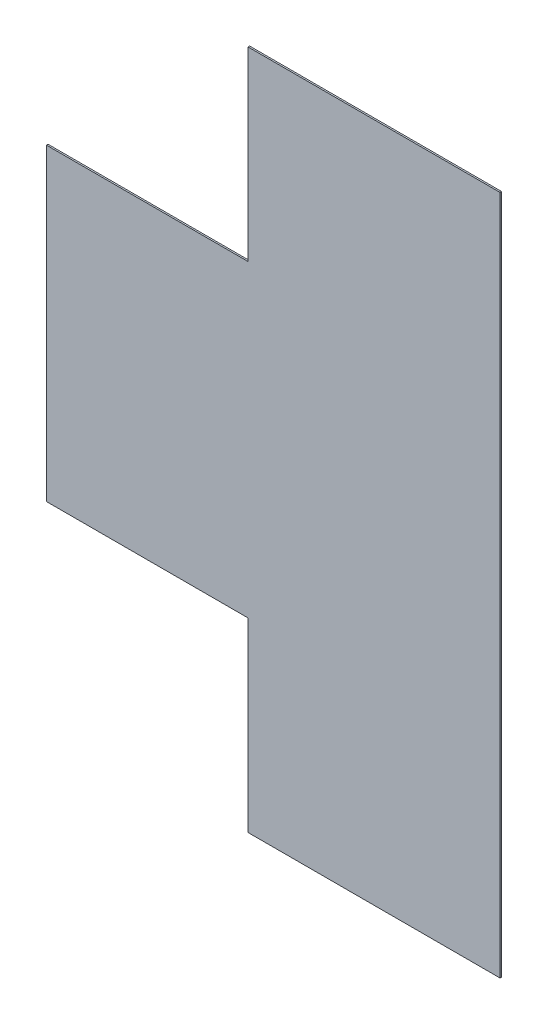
ISO-10303-21;
HEADER;
FILE_DESCRIPTION(('STEP AP214'),'2;1');
FILE_NAME('part.step','',(''),(''),'','','');
FILE_SCHEMA(('AUTOMOTIVE_DESIGN { 1 0 10303 214 1 1 1 1 }'));
ENDSEC;
DATA;
#1=APPLICATION_CONTEXT('core data for automotive mechanical design processes');
#2=APPLICATION_PROTOCOL_DEFINITION('international standard','automotive_design',2000,#1);
#3=PRODUCT_CONTEXT('',#1,'mechanical');
#4=PRODUCT('Part','Part','',(#3));
#5=PRODUCT_RELATED_PRODUCT_CATEGORY('part','',(#4));
#6=PRODUCT_DEFINITION_FORMATION('','',#4);
#7=PRODUCT_DEFINITION_CONTEXT('part definition',#1,'design');
#8=PRODUCT_DEFINITION('design','',#6,#7);
#9=PRODUCT_DEFINITION_SHAPE('','',#8);
#10=(LENGTH_UNIT() NAMED_UNIT(*) SI_UNIT(.MILLI.,.METRE.));
#11=(NAMED_UNIT(*) PLANE_ANGLE_UNIT() SI_UNIT($,.RADIAN.));
#12=(NAMED_UNIT(*) SI_UNIT($,.STERADIAN.) SOLID_ANGLE_UNIT());
#13=UNCERTAINTY_MEASURE_WITH_UNIT(LENGTH_MEASURE(1.E-05),#10,'distance_accuracy_value','');
#14=(GEOMETRIC_REPRESENTATION_CONTEXT(3) GLOBAL_UNCERTAINTY_ASSIGNED_CONTEXT((#13)) GLOBAL_UNIT_ASSIGNED_CONTEXT((#10,
#11,#12)) REPRESENTATION_CONTEXT('',''));
#15=CARTESIAN_POINT('',(0.,0.,0.));
#16=DIRECTION('',(0.,0.,1.));
#17=DIRECTION('',(1.,0.,0.));
#18=AXIS2_PLACEMENT_3D('',#15,#16,#17);
#19=CARTESIAN_POINT('',(279.786998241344,-307.771038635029,1.5875));
#20=DIRECTION('',(-1.,0.,0.));
#21=DIRECTION('',(0.,0.,1.));
#22=AXIS2_PLACEMENT_3D('',#19,#20,#21);
#23=PLANE('',#22);
#24=DIRECTION('',(0.,1.,0.));
#25=VECTOR('',#24,1.);
#26=CARTESIAN_POINT('',(279.786998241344,-307.771038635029,0.));
#27=LINE('',#26,#25);
#28=CARTESIAN_POINT('',(279.786998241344,-993.571038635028,0.));
#29=VERTEX_POINT('',#28);
#30=CARTESIAN_POINT('',(279.786998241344,-307.771038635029,0.));
#31=VERTEX_POINT('',#30);
#32=EDGE_CURVE('E132',#29,#31,#27,.T.);
#33=ORIENTED_EDGE('',*,*,#32,.T.);
#34=DIRECTION('',(0.,0.,-1.));
#35=VECTOR('',#34,1.);
#36=CARTESIAN_POINT('',(279.786998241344,-307.771038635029,1.5875));
#37=LINE('',#36,#35);
#38=CARTESIAN_POINT('',(279.786998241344,-307.771038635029,1.5875));
#39=VERTEX_POINT('',#38);
#40=EDGE_CURVE('E11',#39,#31,#37,.T.);
#41=ORIENTED_EDGE('',*,*,#40,.F.);
#42=DIRECTION('',(0.,1.,0.));
#43=VECTOR('',#42,1.);
#44=CARTESIAN_POINT('',(279.786998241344,-307.771038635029,1.5875));
#45=LINE('',#44,#43);
#46=CARTESIAN_POINT('',(279.786998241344,-993.571038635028,1.5875));
#47=VERTEX_POINT('',#46);
#48=EDGE_CURVE('E146',#47,#39,#45,.T.);
#49=ORIENTED_EDGE('',*,*,#48,.F.);
#50=DIRECTION('',(0.,0.,-1.));
#51=VECTOR('',#50,1.);
#52=CARTESIAN_POINT('',(279.786998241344,-993.571038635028,1.5875));
#53=LINE('',#52,#51);
#54=EDGE_CURVE('E128',#47,#29,#53,.T.);
#55=ORIENTED_EDGE('',*,*,#54,.T.);
#56=EDGE_LOOP('',(#33,#41,#49,#55));
#57=FACE_BOUND('',#56,.T.);
#58=ADVANCED_FACE('F36',(#57),#23,.F.);
#59=CARTESIAN_POINT('',(279.786998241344,-307.771038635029,1.5875));
#60=DIRECTION('',(0.,-1.,0.));
#61=DIRECTION('',(0.,0.,-1.));
#62=AXIS2_PLACEMENT_3D('',#59,#60,#61);
#63=PLANE('',#62);
#64=DIRECTION('',(-1.,0.,0.));
#65=VECTOR('',#64,1.);
#66=CARTESIAN_POINT('',(279.786998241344,-307.771038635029,0.));
#67=LINE('',#66,#65);
#68=CARTESIAN_POINT('',(25.7869982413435,-307.771038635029,0.));
#69=VERTEX_POINT('',#68);
#70=EDGE_CURVE('E135',#31,#69,#67,.T.);
#71=ORIENTED_EDGE('',*,*,#70,.T.);
#72=DIRECTION('',(0.,0.,-1.));
#73=VECTOR('',#72,1.);
#74=CARTESIAN_POINT('',(25.7869982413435,-307.771038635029,1.5875));
#75=LINE('',#74,#73);
#76=CARTESIAN_POINT('',(25.7869982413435,-307.771038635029,1.5875));
#77=VERTEX_POINT('',#76);
#78=EDGE_CURVE('E44',#77,#69,#75,.T.);
#79=ORIENTED_EDGE('',*,*,#78,.F.);
#80=DIRECTION('',(-1.,0.,0.));
#81=VECTOR('',#80,1.);
#82=CARTESIAN_POINT('',(279.786998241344,-307.771038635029,1.5875));
#83=LINE('',#82,#81);
#84=EDGE_CURVE('E95',#39,#77,#83,.T.);
#85=ORIENTED_EDGE('',*,*,#84,.F.);
#86=ORIENTED_EDGE('',*,*,#40,.T.);
#87=EDGE_LOOP('',(#71,#79,#85,#86));
#88=FACE_BOUND('',#87,.T.);
#89=ADVANCED_FACE('F181',(#88),#63,.F.);
#90=CARTESIAN_POINT('',(25.7869982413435,-307.771038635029,1.5875));
#91=DIRECTION('',(1.,0.,0.));
#92=DIRECTION('',(0.,1.,0.));
#93=AXIS2_PLACEMENT_3D('',#90,#91,#92);
#94=PLANE('',#93);
#95=DIRECTION('',(0.,-1.,0.));
#96=VECTOR('',#95,1.);
#97=CARTESIAN_POINT('',(25.7869982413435,-307.771038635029,0.));
#98=LINE('',#97,#96);
#99=CARTESIAN_POINT('',(25.7869982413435,-495.096038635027,0.));
#100=VERTEX_POINT('',#99);
#101=EDGE_CURVE('E137',#69,#100,#98,.T.);
#102=ORIENTED_EDGE('',*,*,#101,.T.);
#103=DIRECTION('',(0.,0.,-1.));
#104=VECTOR('',#103,1.);
#105=CARTESIAN_POINT('',(25.7869982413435,-495.096038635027,1.5875));
#106=LINE('',#105,#104);
#107=CARTESIAN_POINT('',(25.7869982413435,-495.096038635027,1.5875));
#108=VERTEX_POINT('',#107);
#109=EDGE_CURVE('E153',#108,#100,#106,.T.);
#110=ORIENTED_EDGE('',*,*,#109,.F.);
#111=DIRECTION('',(0.,-1.,0.));
#112=VECTOR('',#111,1.);
#113=CARTESIAN_POINT('',(25.7869982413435,-307.771038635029,1.5875));
#114=LINE('',#113,#112);
#115=EDGE_CURVE('E161',#77,#108,#114,.T.);
#116=ORIENTED_EDGE('',*,*,#115,.F.);
#117=ORIENTED_EDGE('',*,*,#78,.T.);
#118=EDGE_LOOP('',(#102,#110,#116,#117));
#119=FACE_BOUND('',#118,.T.);
#120=ADVANCED_FACE('F159',(#119),#94,.F.);
#121=CARTESIAN_POINT('',(-177.413001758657,-495.096038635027,1.5875));
#122=DIRECTION('',(0.,-1.,0.));
#123=DIRECTION('',(0.,0.,-1.));
#124=AXIS2_PLACEMENT_3D('',#121,#122,#123);
#125=PLANE('',#124);
#126=DIRECTION('',(-1.,0.,0.));
#127=VECTOR('',#126,1.);
#128=CARTESIAN_POINT('',(-177.413001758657,-495.096038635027,0.));
#129=LINE('',#128,#127);
#130=CARTESIAN_POINT('',(-177.413001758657,-495.096038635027,0.));
#131=VERTEX_POINT('',#130);
#132=EDGE_CURVE('E139',#100,#131,#129,.T.);
#133=ORIENTED_EDGE('',*,*,#132,.T.);
#134=DIRECTION('',(0.,0.,-1.));
#135=VECTOR('',#134,1.);
#136=CARTESIAN_POINT('',(-177.413001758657,-495.096038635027,1.5875));
#137=LINE('',#136,#135);
#138=CARTESIAN_POINT('',(-177.413001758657,-495.096038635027,1.5875));
#139=VERTEX_POINT('',#138);
#140=EDGE_CURVE('E150',#139,#131,#137,.T.);
#141=ORIENTED_EDGE('',*,*,#140,.F.);
#142=DIRECTION('',(-1.,0.,0.));
#143=VECTOR('',#142,1.);
#144=CARTESIAN_POINT('',(-177.413001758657,-495.096038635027,1.5875));
#145=LINE('',#144,#143);
#146=EDGE_CURVE('E173',#108,#139,#145,.T.);
#147=ORIENTED_EDGE('',*,*,#146,.F.);
#148=ORIENTED_EDGE('',*,*,#109,.T.);
#149=EDGE_LOOP('',(#133,#141,#147,#148));
#150=FACE_BOUND('',#149,.T.);
#151=ADVANCED_FACE('F169',(#150),#125,.F.);
#152=CARTESIAN_POINT('',(-177.413001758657,-806.246038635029,1.5875));
#153=DIRECTION('',(1.,0.,0.));
#154=DIRECTION('',(0.,0.,-1.));
#155=AXIS2_PLACEMENT_3D('',#152,#153,#154);
#156=PLANE('',#155);
#157=DIRECTION('',(0.,-1.,0.));
#158=VECTOR('',#157,1.);
#159=CARTESIAN_POINT('',(-177.413001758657,-806.246038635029,0.));
#160=LINE('',#159,#158);
#161=CARTESIAN_POINT('',(-177.413001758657,-806.246038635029,0.));
#162=VERTEX_POINT('',#161);
#163=EDGE_CURVE('E141',#131,#162,#160,.T.);
#164=ORIENTED_EDGE('',*,*,#163,.T.);
#165=DIRECTION('',(0.,0.,-1.));
#166=VECTOR('',#165,1.);
#167=CARTESIAN_POINT('',(-177.413001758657,-806.246038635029,1.5875));
#168=LINE('',#167,#166);
#169=CARTESIAN_POINT('',(-177.413001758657,-806.246038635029,1.5875));
#170=VERTEX_POINT('',#169);
#171=EDGE_CURVE('E123',#170,#162,#168,.T.);
#172=ORIENTED_EDGE('',*,*,#171,.F.);
#173=DIRECTION('',(0.,-1.,0.));
#174=VECTOR('',#173,1.);
#175=CARTESIAN_POINT('',(-177.413001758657,-806.246038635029,1.5875));
#176=LINE('',#175,#174);
#177=EDGE_CURVE('E114',#139,#170,#176,.T.);
#178=ORIENTED_EDGE('',*,*,#177,.F.);
#179=ORIENTED_EDGE('',*,*,#140,.T.);
#180=EDGE_LOOP('',(#164,#172,#178,#179));
#181=FACE_BOUND('',#180,.T.);
#182=ADVANCED_FACE('F172',(#181),#156,.F.);
#183=CARTESIAN_POINT('',(-177.413001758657,-806.246038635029,1.5875));
#184=DIRECTION('',(0.,1.,0.));
#185=DIRECTION('',(0.,0.,1.));
#186=AXIS2_PLACEMENT_3D('',#183,#184,#185);
#187=PLANE('',#186);
#188=DIRECTION('',(1.,0.,0.));
#189=VECTOR('',#188,1.);
#190=CARTESIAN_POINT('',(-177.413001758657,-806.246038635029,0.));
#191=LINE('',#190,#189);
#192=CARTESIAN_POINT('',(25.7869982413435,-806.246038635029,0.));
#193=VERTEX_POINT('',#192);
#194=EDGE_CURVE('E122',#162,#193,#191,.T.);
#195=ORIENTED_EDGE('',*,*,#194,.T.);
#196=DIRECTION('',(0.,0.,-1.));
#197=VECTOR('',#196,1.);
#198=CARTESIAN_POINT('',(25.7869982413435,-806.246038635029,1.5875));
#199=LINE('',#198,#197);
#200=CARTESIAN_POINT('',(25.7869982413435,-806.246038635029,1.5875));
#201=VERTEX_POINT('',#200);
#202=EDGE_CURVE('E119',#201,#193,#199,.T.);
#203=ORIENTED_EDGE('',*,*,#202,.F.);
#204=DIRECTION('',(1.,0.,0.));
#205=VECTOR('',#204,1.);
#206=CARTESIAN_POINT('',(-177.413001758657,-806.246038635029,1.5875));
#207=LINE('',#206,#205);
#208=EDGE_CURVE('E108',#170,#201,#207,.T.);
#209=ORIENTED_EDGE('',*,*,#208,.F.);
#210=ORIENTED_EDGE('',*,*,#171,.T.);
#211=EDGE_LOOP('',(#195,#203,#209,#210));
#212=FACE_BOUND('',#211,.T.);
#213=ADVANCED_FACE('F120',(#212),#187,.F.);
#214=CARTESIAN_POINT('',(25.7869982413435,-806.246038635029,1.5875));
#215=DIRECTION('',(1.,0.,0.));
#216=DIRECTION('',(0.,0.,-1.));
#217=AXIS2_PLACEMENT_3D('',#214,#215,#216);
#218=PLANE('',#217);
#219=DIRECTION('',(0.,-1.,0.));
#220=VECTOR('',#219,1.);
#221=CARTESIAN_POINT('',(25.7869982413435,-806.246038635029,0.));
#222=LINE('',#221,#220);
#223=CARTESIAN_POINT('',(25.7869982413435,-993.571038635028,0.));
#224=VERTEX_POINT('',#223);
#225=EDGE_CURVE('E81',#193,#224,#222,.T.);
#226=ORIENTED_EDGE('',*,*,#225,.T.);
#227=DIRECTION('',(0.,0.,-1.));
#228=VECTOR('',#227,1.);
#229=CARTESIAN_POINT('',(25.7869982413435,-993.571038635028,1.5875));
#230=LINE('',#229,#228);
#231=CARTESIAN_POINT('',(25.7869982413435,-993.571038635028,1.5875));
#232=VERTEX_POINT('',#231);
#233=EDGE_CURVE('E124',#232,#224,#230,.T.);
#234=ORIENTED_EDGE('',*,*,#233,.F.);
#235=DIRECTION('',(0.,-1.,0.));
#236=VECTOR('',#235,1.);
#237=CARTESIAN_POINT('',(25.7869982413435,-806.246038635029,1.5875));
#238=LINE('',#237,#236);
#239=EDGE_CURVE('E112',#201,#232,#238,.T.);
#240=ORIENTED_EDGE('',*,*,#239,.F.);
#241=ORIENTED_EDGE('',*,*,#202,.T.);
#242=EDGE_LOOP('',(#226,#234,#240,#241));
#243=FACE_BOUND('',#242,.T.);
#244=ADVANCED_FACE('F126',(#243),#218,.F.);
#245=CARTESIAN_POINT('',(279.786998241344,-993.571038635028,1.5875));
#246=DIRECTION('',(0.,1.,0.));
#247=DIRECTION('',(0.,0.,1.));
#248=AXIS2_PLACEMENT_3D('',#245,#246,#247);
#249=PLANE('',#248);
#250=DIRECTION('',(1.,0.,0.));
#251=VECTOR('',#250,1.);
#252=CARTESIAN_POINT('',(279.786998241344,-993.571038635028,0.));
#253=LINE('',#252,#251);
#254=EDGE_CURVE('E87',#224,#29,#253,.T.);
#255=ORIENTED_EDGE('',*,*,#254,.T.);
#256=ORIENTED_EDGE('',*,*,#54,.F.);
#257=DIRECTION('',(1.,0.,0.));
#258=VECTOR('',#257,1.);
#259=CARTESIAN_POINT('',(279.786998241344,-993.571038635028,1.5875));
#260=LINE('',#259,#258);
#261=EDGE_CURVE('E52',#232,#47,#260,.T.);
#262=ORIENTED_EDGE('',*,*,#261,.F.);
#263=ORIENTED_EDGE('',*,*,#233,.T.);
#264=EDGE_LOOP('',(#255,#256,#262,#263));
#265=FACE_BOUND('',#264,.T.);
#266=ADVANCED_FACE('F197',(#265),#249,.F.);
#267=CARTESIAN_POINT('',(0.,0.,1.5875));
#268=DIRECTION('',(0.,0.,-1.));
#269=DIRECTION('',(-1.,0.,0.));
#270=AXIS2_PLACEMENT_3D('',#267,#268,#269);
#271=PLANE('',#270);
#272=ORIENTED_EDGE('',*,*,#48,.T.);
#273=ORIENTED_EDGE('',*,*,#84,.T.);
#274=ORIENTED_EDGE('',*,*,#115,.T.);
#275=ORIENTED_EDGE('',*,*,#146,.T.);
#276=ORIENTED_EDGE('',*,*,#177,.T.);
#277=ORIENTED_EDGE('',*,*,#208,.T.);
#278=ORIENTED_EDGE('',*,*,#239,.T.);
#279=ORIENTED_EDGE('',*,*,#261,.T.);
#280=EDGE_LOOP('',(#272,#273,#274,#275,#276,#277,#278,#279));
#281=FACE_BOUND('',#280,.T.);
#282=ADVANCED_FACE('F110',(#281),#271,.F.);
#283=CARTESIAN_POINT('',(0.,0.,0.));
#284=DIRECTION('',(0.,0.,-1.));
#285=DIRECTION('',(-1.,0.,0.));
#286=AXIS2_PLACEMENT_3D('',#283,#284,#285);
#287=PLANE('',#286);
#288=ORIENTED_EDGE('',*,*,#32,.F.);
#289=ORIENTED_EDGE('',*,*,#254,.F.);
#290=ORIENTED_EDGE('',*,*,#225,.F.);
#291=ORIENTED_EDGE('',*,*,#194,.F.);
#292=ORIENTED_EDGE('',*,*,#163,.F.);
#293=ORIENTED_EDGE('',*,*,#132,.F.);
#294=ORIENTED_EDGE('',*,*,#101,.F.);
#295=ORIENTED_EDGE('',*,*,#70,.F.);
#296=EDGE_LOOP('',(#288,#289,#290,#291,#292,#293,#294,#295));
#297=FACE_BOUND('',#296,.T.);
#298=ADVANCED_FACE('F165',(#297),#287,.T.);
#299=CLOSED_SHELL('',(#58,#89,#120,#151,#182,#213,#244,#266,#282,#298));
#300=MANIFOLD_SOLID_BREP('B2',#299);
#301=ADVANCED_BREP_SHAPE_REPRESENTATION('',(#18,#300),#14);
#302=SHAPE_DEFINITION_REPRESENTATION(#9,#301);
ENDSEC;
END-ISO-10303-21;
